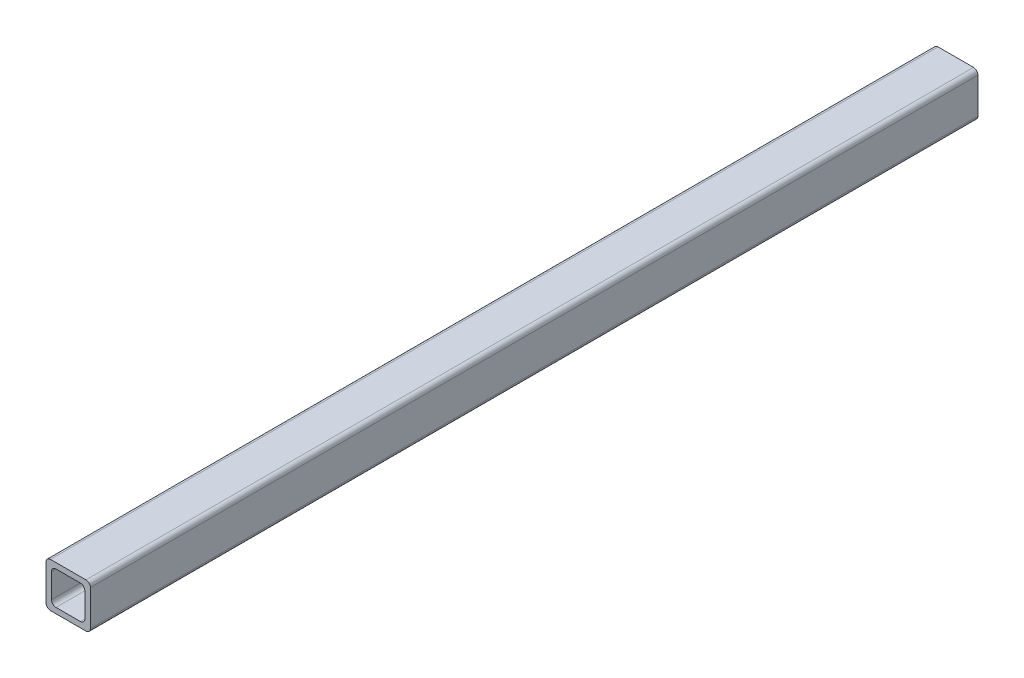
from build123d import *

# Parameters (mm, degrees)
BOSS_EXTRU_2_DEPTH = 400


with BuildPart() as part:
    # Esquisse1 → Boss.-Extru.2 (new body)
    with BuildSketch(Plane.XY):
        with BuildLine():
            Line((6.49902662, -10), (-9.50097338, -10))
            ThreePointArc((-9.50097338, -10), (-10.915186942, -9.414213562), (-11.50097338, -8))
            Line((-11.50097338, -8), (-11.50097338, 8))
            ThreePointArc((-11.50097338, 8), (-10.915186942, 9.414213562), (-9.50097338, 10))
            Line((-9.50097338, 10), (6.49902662, 10))
            ThreePointArc((6.49902662, 10), (7.913240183, 9.414213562), (8.49902662, 8))
            Line((8.49902662, 8), (8.49902662, -8))
            ThreePointArc((8.49902662, -8), (7.913240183, -9.414213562), (6.49902662, -10))
        make_face()
        with BuildLine():
            Line((3.99902662, 7.5), (-7.00097338, 7.5))
            ThreePointArc((-7.00097338, 7.5), (-8.415186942, 6.914213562), (-9.00097338, 5.5))
            Line((-9.00097338, 5.5), (-9.00097338, -5.5))
            ThreePointArc((-9.00097338, -5.5), (-8.415186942, -6.914213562), (-7.00097338, -7.5))
            Line((-7.00097338, -7.5), (3.99902662, -7.5))
            ThreePointArc((3.99902662, -7.5), (5.413240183, -6.914213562), (5.99902662, -5.5))
            Line((5.99902662, -5.5), (5.99902662, 5.5))
            ThreePointArc((5.99902662, 5.5), (5.413240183, 6.914213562), (3.99902662, 7.5))
        make_face(mode=Mode.SUBTRACT)
    extrude(amount=BOSS_EXTRU_2_DEPTH)


solid = part.part
